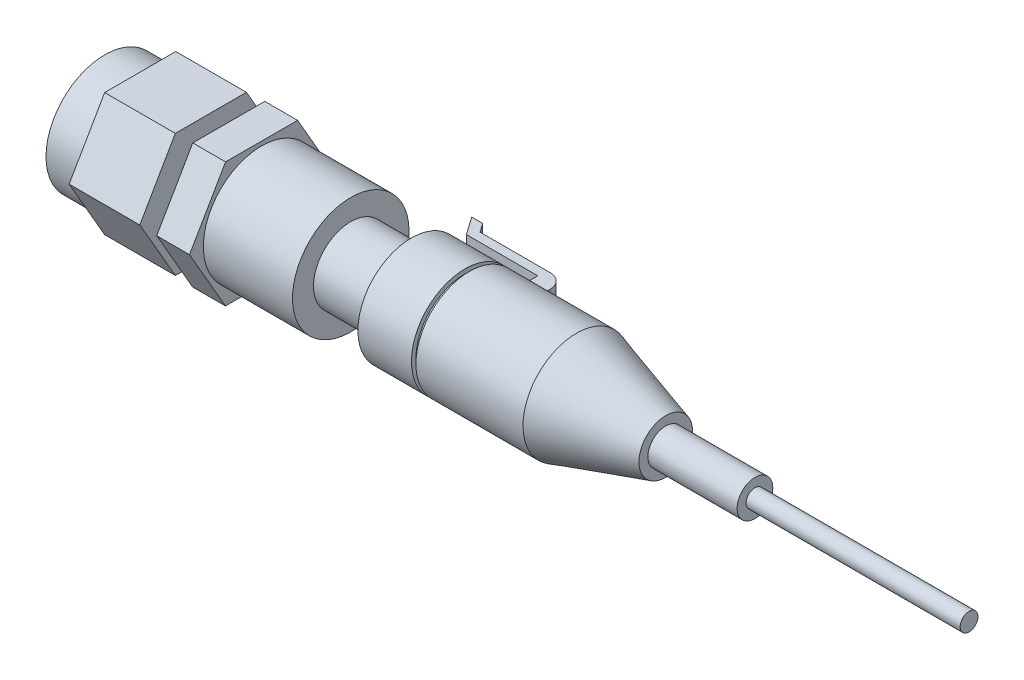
from build123d import *

# Parameters (mm, degrees)
SKETCH1_R               = 10.3632
BOSS_EXTRUDE1_DEPTH     = 15.875
BOSS_EXTRUDE2_DEPTH     = 5.842
SKETCH3_R               = 3.131421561
BOSS_EXTRUDE3_DEPTH     = 3.175
BOSS_EXTRUDE4_DEPTH     = 12.573
SKETCH5_R               = 10.4775
BOSS_EXTRUDE5_DEPTH     = 6.2865
SKETCH6_R               = 6.63575
BOSS_EXTRUDE6_DEPTH     = 10.795
SKETCH7_R               = 9.525
BOSS_EXTRUDE7_DEPTH     = 9.525
SKETCH9_R               = 8.7376
BOSS_EXTRUDE8_DEPTH     = 0.79375
SKETCH10_R              = 9.525
BOSS_EXTRUDE9_DEPTH     = 19.05
CUT_EXTRUDE1_DEPTH      = 1.5875
CUT_EXTRUDE2_REACH      = 51.292
CUT_EXTRUDE2_END_RADIUS = 9.525
SKETCH12_W              = 3.175
SKETCH12_H              = 3.175
BOSS_EXTRUDE10_DEPTH    = 6.35
SKETCH13_W              = 1.5875
SKETCH13_H              = 3.175
BOSS_EXTRUDE11_DEPTH    = 12.7
BOSS_EXTRUDE12_DEPTH    = 3.175
BOSS_EXTRUDE13_DEPTH    = 3.175
BOSS_EXTRUDE15_DEPTH    = 9.525
SKETCH20_W              = 0.79375
SKETCH20_H              = 1.5875
BOSS_EXTRUDE16_DEPTH    = 3.175
SKETCH22_R              = 3.175
BOSS_EXTRUDE17_DEPTH    = 15.875
SKETCH23_R              = 1.5875
BOSS_EXTRUDE18_DEPTH    = 38.1
FILLET3_R               = 2.54
FILLET4_R               = 2.54


with BuildPart() as part:
    # Sketch1 → Boss-Extrude1 (new body)
    with BuildSketch(Plane(origin=(0, 0, 0), x_dir=(0, 0, -1), z_dir=(1, 0, 0))):
        Circle(SKETCH1_R)
    extrude(amount=-BOSS_EXTRUDE1_DEPTH)

    # Sketch2 → Boss-Extrude2 (add)
    with BuildSketch(Plane.ZY.offset(15.875)):
        Polygon((6.397302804, 11.106241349), (-6.419635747, 11.093347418), (-12.81693855, -0.012893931), (-6.397302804, -11.106241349), (6.419635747, -11.093347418), (12.81693855, 0.012893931), align=None)
    extrude(amount=BOSS_EXTRUDE2_DEPTH)

    # Sketch3 → Boss-Extrude3 (add)
    with BuildSketch(Plane.ZY.offset(21.717)):
        Circle(SKETCH3_R)
    extrude(amount=BOSS_EXTRUDE3_DEPTH)

    # Sketch4 → Boss-Extrude4 (add)
    with BuildSketch(Plane.ZY.offset(24.892)):
        Polygon((-12.648301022, 0), (-6.324150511, -10.95375), (6.324150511, -10.95375), (12.648301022, 0), (6.324150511, 10.95375), (-6.324150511, 10.95375), align=None)
    extrude(amount=BOSS_EXTRUDE4_DEPTH)

    # Sketch5 → Boss-Extrude5 (add)
    with BuildSketch(Plane.ZY.offset(37.465)):
        Circle(SKETCH5_R)
    extrude(amount=BOSS_EXTRUDE5_DEPTH)

    # Sketch6 → Boss-Extrude6 (add)
    with BuildSketch(Plane(origin=(0, 0, 0), x_dir=(0, 0, -1), z_dir=(1, 0, 0))):
        Circle(SKETCH6_R)
    extrude(amount=BOSS_EXTRUDE6_DEPTH)

    # Sketch7 → Boss-Extrude7 (add)
    with BuildSketch(Plane(origin=(10.795, 0, 0), x_dir=(0, 0, -1), z_dir=(1, 0, 0))):
        with Locations(Location((0, 0, 0), (0, 0, 180))):
            Circle(SKETCH7_R)
    extrude(amount=BOSS_EXTRUDE7_DEPTH)

    # Sketch9 → Boss-Extrude8 (add)
    with BuildSketch(Plane(origin=(20.32, 0, 0), x_dir=(0, 0, -1), z_dir=(1, 0, 0))):
        Circle(SKETCH9_R)
    extrude(amount=BOSS_EXTRUDE8_DEPTH)

    # Sketch10 → Boss-Extrude9 (add)
    with BuildSketch(Plane(origin=(21.11375, 0, 0), x_dir=(0, 0, -1), z_dir=(1, 0, 0))):
        with Locations(Location((0, 0, 0), (0, 0, 180))):
            Circle(SKETCH10_R)
    extrude(amount=BOSS_EXTRUDE9_DEPTH)

    # Sketch11 → Cut-Extrude1 (cut)
    with BuildSketch(Plane.XY.offset(-6.985)):
        Polygon((27.46375, 5.844282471), (27.46375, -5.844282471), (20.32, -5.844282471), (20.32, -1.410545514), (23.495, -1.410545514), (23.495, 1.410545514), (20.32, 1.410545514), (20.32, 5.844282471), align=None)
    extrude(amount=CUT_EXTRUDE1_DEPTH, mode=Mode.SUBTRACT)

    # Cut-Extrude2: up to this cylinder (the profile starts inside it)
    cut_extrude2_end = Plane(origin=(24.130314, 0, 0), z_dir=(-1, 0, 0)) * Cylinder(CUT_EXTRUDE2_END_RADIUS, 122.634, mode=Mode.PRIVATE)
    # Sketch11_2 → Cut-Extrude2 (cut, up to the surface)
    with BuildSketch(Plane.XY.offset(-6.985), mode=Mode.PRIVATE) as cut_extrude2_sk1:
        Polygon((27.46375, 5.844282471), (27.46375, -5.844282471), (20.32, -5.844282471), (20.32, -1.410545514), (23.495, -1.410545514), (23.495, 1.410545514), (20.32, 1.410545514), (20.32, 5.844282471), align=None)
    cut_extrude2_tool1 = extrude(cut_extrude2_sk1.sketch, amount=-CUT_EXTRUDE2_REACH, mode=Mode.PRIVATE) & cut_extrude2_end
    add(cut_extrude2_tool1.solids().sort_by_distance((24.130314, 0, -6.985))[0], mode=Mode.SUBTRACT)

    # Sketch12 → Boss-Extrude10 (add)
    with BuildSketch(Plane(origin=(0, 0, -5.3975), x_dir=(-1, 0, 0), z_dir=(0, 0, -1))):
        with Locations((-24.69818991, -3.175)):
            Rectangle(SKETCH12_W, SKETCH12_H)
        with Locations((-24.69818991, 3.175)):
            Rectangle(SKETCH12_W, SKETCH12_H)
    extrude(amount=BOSS_EXTRUDE10_DEPTH)

    # Sketch13 → Boss-Extrude11 (add)
    with BuildSketch(Plane.ZY.offset(-23.11068991)):
        with Locations((-10.95375, -3.175)):
            Rectangle(SKETCH13_W, SKETCH13_H)
        with Locations((-10.95375, 3.175)):
            Rectangle(SKETCH13_W, SKETCH13_H)
    extrude(amount=BOSS_EXTRUDE11_DEPTH)

    # Sketch14 → Boss-Extrude12 (add)
    with BuildSketch(Plane.XZ.offset(4.7625)):
        Polygon((12.364173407, -10.16), (10.141014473, -13.335), (8.187530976, -13.335), (10.41068991, -10.16), align=None)
    extrude(amount=-BOSS_EXTRUDE12_DEPTH)

    # Sketch16 → Boss-Extrude13 (add)
    with BuildSketch(Plane(origin=(0, 4.7625, 0), x_dir=(1, 0, 0), z_dir=(0, 1, 0))):
        Polygon((10.41068991, 10.16), (8.187530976, 13.335), (10.141014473, 13.335), (12.364173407, 10.16), align=None)
    extrude(amount=-BOSS_EXTRUDE13_DEPTH)

    # Sketch19 → Boss-Extrude15 (add)
    with BuildSketch(Plane(origin=(0, 4.7625, 0), x_dir=(1, 0, 0), z_dir=(0, 1, 0))):
        Polygon((10.954633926, 12.173031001), (10.141014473, 13.335), (8.187530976, 13.335), (9.001150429, 12.173031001), align=None)
    extrude(amount=-BOSS_EXTRUDE15_DEPTH)

    # Sketch21 → Revolve1 (revolve)
    with BuildSketch(Plane.XY, mode=Mode.PRIVATE) as revolve1_sk:
        Polygon((40.16375, 0), (40.16375, 9.525), (56.03875, 4.7625), (56.03875, 0), align=None)
    revolve(revolve1_sk.sketch.rotate(Axis((56.03875, 0, 0), (-1, 0, 0)), 52.151697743), axis=Axis((56.03875, 0, 0), (-1, 0, 0)))

    # Sketch22 → Boss-Extrude17 (add)
    with BuildSketch(Plane(origin=(56.03875, 0, 0), x_dir=(0, 0, -1), z_dir=(1, 0, 0))):
        with Locations(Location((0, 0, 0), (0, 0, 90))):
            Circle(SKETCH22_R)
    extrude(amount=BOSS_EXTRUDE17_DEPTH)

    # Sketch23 → Boss-Extrude18 (add)
    with BuildSketch(Plane(origin=(71.91375, 0, 0), x_dir=(0, 0, -1), z_dir=(1, 0, 0))):
        with Locations(Location((0, 0, 0), (0, 0, 270))):
            Circle(SKETCH23_R)
    extrude(amount=BOSS_EXTRUDE18_DEPTH)

    # Fillet3
    fillet3_edges = [part.edges().sort_by_distance(p)[0] for p in [
        (26.28568991, 3.175, -11.7475),
    ]]
    fillet(fillet3_edges, radius=FILLET3_R)

    # Fillet4
    fillet4_edges = [part.edges().sort_by_distance(p)[0] for p in [
        (26.28568991, -3.175, -11.7475),
    ]]
    fillet(fillet4_edges, radius=FILLET4_R)


with BuildPart() as body_2:
    # Sketch20 → Boss-Extrude16 (new body)
    with BuildSketch(Plane.XY.offset(-9.525)):
        with Locations((11.84790644, 0)):
            Rectangle(SKETCH20_W, SKETCH20_H)
    extrude(amount=-BOSS_EXTRUDE16_DEPTH)


solid = Compound([part.part, body_2.part])
